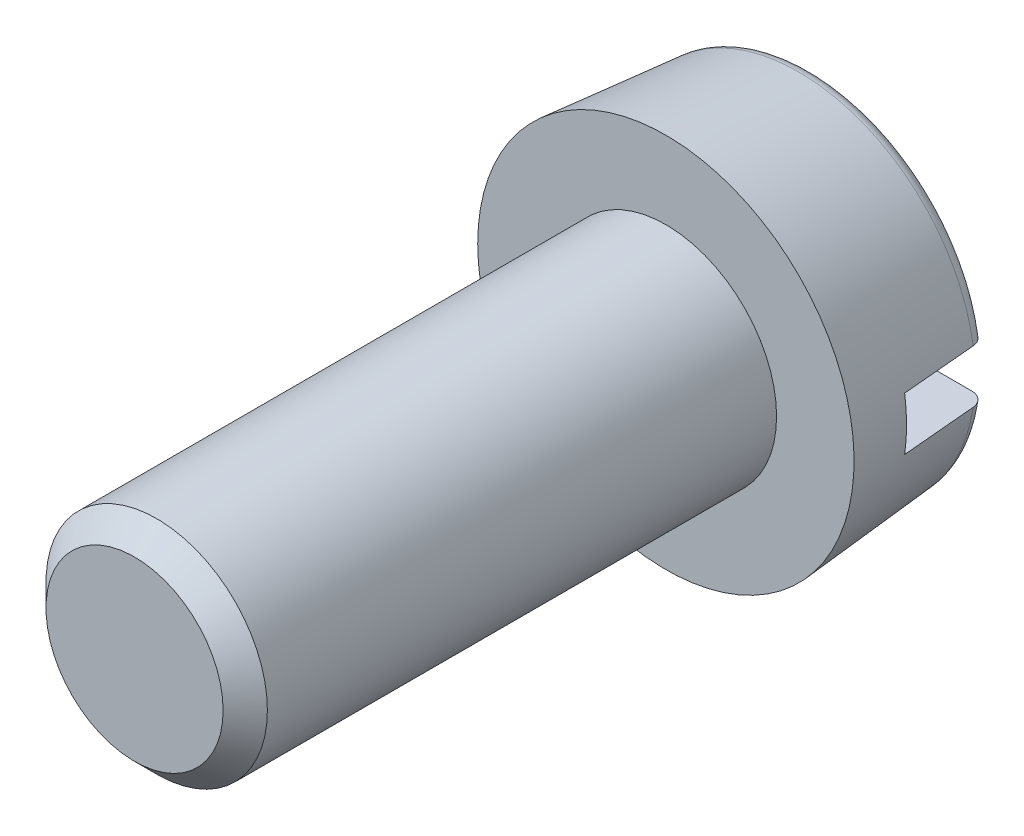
ISO-10303-21;
HEADER;
FILE_DESCRIPTION(('STEP AP214'),'2;1');
FILE_NAME('part.step','',(''),(''),'','','');
FILE_SCHEMA(('AUTOMOTIVE_DESIGN { 1 0 10303 214 1 1 1 1 }'));
ENDSEC;
DATA;
#1=APPLICATION_CONTEXT('core data for automotive mechanical design processes');
#2=APPLICATION_PROTOCOL_DEFINITION('international standard','automotive_design',2000,#1);
#3=PRODUCT_CONTEXT('',#1,'mechanical');
#4=PRODUCT('Part','Part','',(#3));
#5=PRODUCT_RELATED_PRODUCT_CATEGORY('part','',(#4));
#6=PRODUCT_DEFINITION_FORMATION('','',#4);
#7=PRODUCT_DEFINITION_CONTEXT('part definition',#1,'design');
#8=PRODUCT_DEFINITION('design','',#6,#7);
#9=PRODUCT_DEFINITION_SHAPE('','',#8);
#10=(LENGTH_UNIT() NAMED_UNIT(*) SI_UNIT(.MILLI.,.METRE.));
#11=(NAMED_UNIT(*) PLANE_ANGLE_UNIT() SI_UNIT($,.RADIAN.));
#12=(NAMED_UNIT(*) SI_UNIT($,.STERADIAN.) SOLID_ANGLE_UNIT());
#13=UNCERTAINTY_MEASURE_WITH_UNIT(LENGTH_MEASURE(1.E-05),#10,'distance_accuracy_value','');
#14=(GEOMETRIC_REPRESENTATION_CONTEXT(3) GLOBAL_UNCERTAINTY_ASSIGNED_CONTEXT((#13)) GLOBAL_UNIT_ASSIGNED_CONTEXT((#10,
#11,#12)) REPRESENTATION_CONTEXT('',''));
#15=CARTESIAN_POINT('',(0.,0.,0.));
#16=DIRECTION('',(0.,0.,1.));
#17=DIRECTION('',(1.,0.,0.));
#18=AXIS2_PLACEMENT_3D('',#15,#16,#17);
#19=CARTESIAN_POINT('',(0.,0.,-3.3));
#20=DIRECTION('',(0.,0.,1.));
#21=DIRECTION('',(1.,0.,0.));
#22=AXIS2_PLACEMENT_3D('',#19,#20,#21);
#23=PLANE('',#22);
#24=DIRECTION('',(1.,0.,0.));
#25=VECTOR('',#24,1.);
#26=CARTESIAN_POINT('',(-4.25,-0.6,-3.3));
#27=LINE('',#26,#25);
#28=CARTESIAN_POINT('',(-3.60936773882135,-0.6,-3.3));
#29=VERTEX_POINT('',#28);
#30=CARTESIAN_POINT('',(3.60936773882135,-0.6,-3.3));
#31=VERTEX_POINT('',#30);
#32=EDGE_CURVE('E184',#29,#31,#27,.T.);
#33=ORIENTED_EDGE('',*,*,#32,.T.);
#34=CARTESIAN_POINT('',(0.,0.,-3.3));
#35=DIRECTION('',(0.,0.,-1.));
#36=DIRECTION('',(-1.,0.,0.));
#37=AXIS2_PLACEMENT_3D('',#34,#35,#36);
#38=CIRCLE('',#37,3.6588981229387);
#39=EDGE_CURVE('E116',#31,#29,#38,.T.);
#40=ORIENTED_EDGE('',*,*,#39,.T.);
#41=EDGE_LOOP('',(#33,#40));
#42=FACE_BOUND('',#41,.T.);
#43=ADVANCED_FACE('F36',(#42),#23,.F.);
#44=DIRECTION('',(-1.,0.,0.));
#45=VECTOR('',#44,1.);
#46=CARTESIAN_POINT('',(-4.25,0.6,-3.3));
#47=LINE('',#46,#45);
#48=CARTESIAN_POINT('',(3.60936773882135,0.6,-3.3));
#49=VERTEX_POINT('',#48);
#50=CARTESIAN_POINT('',(-3.60936773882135,0.6,-3.3));
#51=VERTEX_POINT('',#50);
#52=EDGE_CURVE('E101',#49,#51,#47,.T.);
#53=ORIENTED_EDGE('',*,*,#52,.T.);
#54=EDGE_CURVE('E113',#51,#49,#38,.T.);
#55=ORIENTED_EDGE('',*,*,#54,.T.);
#56=EDGE_LOOP('',(#53,#55));
#57=FACE_BOUND('',#56,.T.);
#58=ADVANCED_FACE('F178',(#57),#23,.F.);
#59=CARTESIAN_POINT('',(0.,0.,-2.97));
#60=DIRECTION('',(0.,0.,-1.));
#61=DIRECTION('',(-1.,0.,0.));
#62=AXIS2_PLACEMENT_3D('',#59,#60,#61);
#63=TOROIDAL_SURFACE('',#62,3.6588981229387,0.330000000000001);
#64=CARTESIAN_POINT('',(-3.88093121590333,-0.6,-3.16235651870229));
#65=CARTESIAN_POINT('',(-3.89174650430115,-0.6,-3.14745596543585));
#66=CARTESIAN_POINT('',(-3.90131895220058,-0.6,-3.13163782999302));
#67=CARTESIAN_POINT('',(-3.91768386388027,-0.6,-3.09860811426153));
#68=CARTESIAN_POINT('',(-3.92447332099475,-0.6,-3.08139505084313));
#69=CARTESIAN_POINT('',(-3.93505791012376,-0.6,-3.04607287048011));
#70=CARTESIAN_POINT('',(-3.93885357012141,-0.6,-3.02796391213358));
#71=CARTESIAN_POINT('',(-3.94333535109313,-0.6,-2.99136961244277));
#72=CARTESIAN_POINT('',(-3.94402220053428,-0.6,-2.97288436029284));
#73=CARTESIAN_POINT('',(-3.94227140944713,-0.6,-2.9361368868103));
#74=CARTESIAN_POINT('',(-3.93984626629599,-0.6,-2.91787406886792));
#75=CARTESIAN_POINT('',(-3.93196602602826,-0.6,-2.88201412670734));
#76=CARTESIAN_POINT('',(-3.92651084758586,-0.6,-2.86441702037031));
#77=CARTESIAN_POINT('',(-3.91272898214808,-0.6,-2.83037210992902));
#78=CARTESIAN_POINT('',(-3.90440030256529,-0.6,-2.81392511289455));
#79=CARTESIAN_POINT('',(-3.88511861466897,-0.6,-2.78264968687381));
#80=CARTESIAN_POINT('',(-3.87416553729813,-0.6,-2.76782130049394));
#81=CARTESIAN_POINT('',(-3.84986660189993,-0.6,-2.74008712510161));
#82=CARTESIAN_POINT('',(-3.83650421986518,-0.6,-2.7271958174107));
#83=CARTESIAN_POINT('',(-3.80782590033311,-0.6,-2.70380952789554));
#84=CARTESIAN_POINT('',(-3.79250985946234,-0.6,-2.69331467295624));
#85=CARTESIAN_POINT('',(-3.76017561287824,-0.6,-2.67489241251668));
#86=CARTESIAN_POINT('',(-3.74314020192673,-0.6,-2.66699520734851));
#87=CARTESIAN_POINT('',(-3.70799548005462,-0.6,-2.65413616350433));
#88=CARTESIAN_POINT('',(-3.68988609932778,-0.6,-2.64917451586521));
#89=CARTESIAN_POINT('',(-3.65288598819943,-0.6,-2.64227180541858));
#90=CARTESIAN_POINT('',(-3.63398869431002,-0.6,-2.64036590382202));
#91=CARTESIAN_POINT('',(-3.59614043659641,-0.6,-2.63972980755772));
#92=CARTESIAN_POINT('',(-3.57718947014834,-0.6,-2.64099977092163));
#93=CARTESIAN_POINT('',(-3.53963364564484,-0.6,-2.64669886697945));
#94=CARTESIAN_POINT('',(-3.52103209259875,-0.6,-2.65114981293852));
#95=CARTESIAN_POINT('',(-3.48484117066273,-0.6,-2.66311534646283));
#96=CARTESIAN_POINT('',(-3.46725181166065,-0.6,-2.67062996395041));
#97=CARTESIAN_POINT('',(-3.43361753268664,-0.6,-2.68850884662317));
#98=CARTESIAN_POINT('',(-3.41757045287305,-0.6,-2.69886904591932));
#99=CARTESIAN_POINT('',(-3.38746679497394,-0.6,-2.72216302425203));
#100=CARTESIAN_POINT('',(-3.37341012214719,-0.6,-2.73509668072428));
#101=CARTESIAN_POINT('',(-3.34784979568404,-0.6,-2.76303096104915));
#102=CARTESIAN_POINT('',(-3.33632096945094,-0.6,-2.77800854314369));
#103=CARTESIAN_POINT('',(-3.31598781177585,-0.6,-2.80971149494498));
#104=CARTESIAN_POINT('',(-3.30718323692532,-0.6,-2.82643670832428));
#105=CARTESIAN_POINT('',(-3.29269082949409,-0.6,-2.86088519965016));
#106=CARTESIAN_POINT('',(-3.28695731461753,-0.6,-2.87858926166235));
#107=CARTESIAN_POINT('',(-3.27858571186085,-0.6,-2.91471449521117));
#108=CARTESIAN_POINT('',(-3.27594737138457,-0.6,-2.93313560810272));
#109=CARTESIAN_POINT('',(-3.27386359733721,-0.6,-2.96992922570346));
#110=CARTESIAN_POINT('',(-3.27437926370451,-0.6,-2.9882995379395));
#111=CARTESIAN_POINT('',(-3.27849603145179,-0.6,-3.02469054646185));
#112=CARTESIAN_POINT('',(-3.28209704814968,-0.6,-3.04271125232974));
#113=CARTESIAN_POINT('',(-3.29225896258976,-0.6,-3.0778495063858));
#114=CARTESIAN_POINT('',(-3.2988126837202,-0.6,-3.09496913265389));
#115=CARTESIAN_POINT('',(-3.31467711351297,-0.6,-3.12787861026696));
#116=CARTESIAN_POINT('',(-3.3239879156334,-0.6,-3.14366841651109));
#117=CARTESIAN_POINT('',(-3.34518159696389,-0.6,-3.17362232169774));
#118=CARTESIAN_POINT('',(-3.35708617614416,-0.6,-3.18777106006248));
#119=CARTESIAN_POINT('',(-3.38307011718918,-0.6,-3.21390575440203));
#120=CARTESIAN_POINT('',(-3.397149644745,-0.6,-3.22589154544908));
#121=CARTESIAN_POINT('',(-3.42730774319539,-0.6,-3.24754984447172));
#122=CARTESIAN_POINT('',(-3.44341295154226,-0.6,-3.25718526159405));
#123=CARTESIAN_POINT('',(-3.47699616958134,-0.6,-3.27365724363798));
#124=CARTESIAN_POINT('',(-3.49447428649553,-0.6,-3.28049358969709));
#125=CARTESIAN_POINT('',(-3.530559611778,-0.6,-3.29126249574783));
#126=CARTESIAN_POINT('',(-3.54917882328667,-0.6,-3.29515486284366));
#127=CARTESIAN_POINT('',(-3.58680532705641,-0.6,-3.29977905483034));
#128=CARTESIAN_POINT('',(-3.60581262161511,-0.6,-3.30051086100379));
#129=CARTESIAN_POINT('',(-3.64379387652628,-0.6,-3.29878612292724));
#130=CARTESIAN_POINT('',(-3.6627669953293,-0.6,-3.29631095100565));
#131=CARTESIAN_POINT('',(-3.70003092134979,-0.6,-3.2881993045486));
#132=CARTESIAN_POINT('',(-3.71832156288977,-0.6,-3.28256206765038));
#133=CARTESIAN_POINT('',(-3.75363601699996,-0.6,-3.26829463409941));
#134=CARTESIAN_POINT('',(-3.77066317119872,-0.6,-3.25967270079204));
#135=CARTESIAN_POINT('',(-3.80299261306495,-0.6,-3.23966998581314));
#136=CARTESIAN_POINT('',(-3.81829702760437,-0.6,-3.22829266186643));
#137=CARTESIAN_POINT('',(-3.84151948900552,-0.6,-3.20772421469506));
#138=CARTESIAN_POINT('',(-3.85009030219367,-0.6,-3.19925784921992));
#139=CARTESIAN_POINT('',(-3.86626148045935,-0.6,-3.18144383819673));
#140=CARTESIAN_POINT('',(-3.87386185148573,-0.6,-3.17209619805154));
#141=CARTESIAN_POINT('',(-3.88093121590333,-0.6,-3.16235651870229));
#142=B_SPLINE_CURVE_WITH_KNOTS('',3,(#64,#65,#66,#67,#68,#69,#70,#71,#72,#73,#74,#75,#76,#77,
#78,#79,#80,#81,#82,#83,#84,#85,#86,#87,#88,#89,#90,#91,#92,#93,#94,#95,#96,#97,#98,#99,#100,
#101,#102,#103,#104,#105,#106,#107,#108,#109,#110,#111,#112,#113,#114,#115,#116,#117,#118,#119,
#120,#121,#122,#123,#124,#125,#126,#127,#128,#129,#130,#131,#132,#133,#134,#135,#136,#137,#138,
#139,#140,#141),.UNSPECIFIED.,.T.,.F.,(4,2,2,2,2,2,2,2,2,2,2,2,2,2,2,2,2,2,2,2,2,2,2,2,2,2,2,2,
2,2,2,2,2,2,2,2,2,2,4),(0.,0.055192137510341,0.110443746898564,0.165685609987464,
0.220914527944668,0.275922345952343,0.330931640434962,0.38597915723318,0.441028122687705,
0.496470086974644,0.551914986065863,0.607983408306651,0.664055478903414,0.720768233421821,
0.777483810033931,0.834592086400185,0.891700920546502,0.948728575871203,1.00575351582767,
1.06218182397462,1.11860508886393,1.17416394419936,1.22971826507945,1.28458879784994,
1.3394578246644,1.39419420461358,1.44893244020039,1.50414752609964,1.55936682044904,
1.61540809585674,1.67145375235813,1.72825141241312,1.78504940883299,1.84217879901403,
1.89932196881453,1.95630818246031,2.0132232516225,2.04929956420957,2.08537565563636),.UNSPECIFIED.);
#143=CARTESIAN_POINT('',(-3.94224449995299,-0.6,-2.99876139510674));
#144=VERTEX_POINT('',#143);
#145=EDGE_CURVE('E58',#29,#144,#142,.T.);
#146=ORIENTED_EDGE('',*,*,#145,.F.);
#147=ORIENTED_EDGE('',*,*,#39,.F.);
#148=CARTESIAN_POINT('',(3.29440264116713,-0.6,-3.08230315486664));
#149=CARTESIAN_POINT('',(3.28809785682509,-0.6,-3.0651620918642));
#150=CARTESIAN_POINT('',(3.28322982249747,-0.6,-3.04747923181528));
#151=CARTESIAN_POINT('',(3.27652850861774,-0.6,-3.01153352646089));
#152=CARTESIAN_POINT('',(3.27469849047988,-0.6,-2.99327007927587));
#153=CARTESIAN_POINT('',(3.27413756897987,-0.6,-2.95670045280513));
#154=CARTESIAN_POINT('',(3.27540558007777,-0.6,-2.93839429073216));
#155=CARTESIAN_POINT('',(3.28099874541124,-0.6,-2.90226005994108));
#156=CARTESIAN_POINT('',(3.28532324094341,-0.6,-2.88443188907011));
#157=CARTESIAN_POINT('',(3.29689219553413,-0.6,-2.84975492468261));
#158=CARTESIAN_POINT('',(3.30413599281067,-0.6,-2.8329059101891));
#159=CARTESIAN_POINT('',(3.3213231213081,-0.6,-2.80064624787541));
#160=CARTESIAN_POINT('',(3.33126664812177,-0.6,-2.7852357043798));
#161=CARTESIAN_POINT('',(3.35366868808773,-0.6,-2.75612471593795));
#162=CARTESIAN_POINT('',(3.3661508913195,-0.6,-2.74244250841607));
#163=CARTESIAN_POINT('',(3.3932045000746,-0.6,-2.71732930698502));
#164=CARTESIAN_POINT('',(3.40777606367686,-0.6,-2.7058984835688));
#165=CARTESIAN_POINT('',(3.4388307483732,-0.6,-2.6854297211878));
#166=CARTESIAN_POINT('',(3.45533944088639,-0.6,-2.67643057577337));
#167=CARTESIAN_POINT('',(3.48961941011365,-0.6,-2.66129114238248));
#168=CARTESIAN_POINT('',(3.50739077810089,-0.6,-2.65515106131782));
#169=CARTESIAN_POINT('',(3.54393539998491,-0.6,-2.64582999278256));
#170=CARTESIAN_POINT('',(3.56271853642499,-0.6,-2.64268771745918));
#171=CARTESIAN_POINT('',(3.60054621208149,-0.6,-2.63958409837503));
#172=CARTESIAN_POINT('',(3.61959076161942,-0.6,-2.63962288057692));
#173=CARTESIAN_POINT('',(3.65749738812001,-0.6,-2.64289265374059));
#174=CARTESIAN_POINT('',(3.6763581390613,-0.6,-2.64613906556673));
#175=CARTESIAN_POINT('',(3.71326281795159,-0.6,-2.65576554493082));
#176=CARTESIAN_POINT('',(3.73130675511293,-0.6,-2.66214557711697));
#177=CARTESIAN_POINT('',(3.76597993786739,-0.6,-2.67783761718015));
#178=CARTESIAN_POINT('',(3.78261484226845,-0.6,-2.68713711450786));
#179=CARTESIAN_POINT('',(3.81406528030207,-0.6,-2.70842491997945));
#180=CARTESIAN_POINT('',(3.82888090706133,-0.6,-2.72041309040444));
#181=CARTESIAN_POINT('',(3.85610446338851,-0.6,-2.74660594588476));
#182=CARTESIAN_POINT('',(3.8685359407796,-0.6,-2.76078615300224));
#183=CARTESIAN_POINT('',(3.89080726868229,-0.6,-2.79105382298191));
#184=CARTESIAN_POINT('',(3.90064729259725,-0.6,-2.80714115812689));
#185=CARTESIAN_POINT('',(3.91733416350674,-0.6,-2.8405601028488));
#186=CARTESIAN_POINT('',(3.92421525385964,-0.6,-2.85787461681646));
#187=CARTESIAN_POINT('',(3.93494358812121,-0.6,-2.89341927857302));
#188=CARTESIAN_POINT('',(3.93879100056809,-0.6,-2.91164937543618));
#189=CARTESIAN_POINT('',(3.94331406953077,-0.6,-2.94833527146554));
#190=CARTESIAN_POINT('',(3.94401737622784,-0.6,-2.9667876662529));
#191=CARTESIAN_POINT('',(3.94230652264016,-0.6,-3.00354703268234));
#192=CARTESIAN_POINT('',(3.9398924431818,-0.6,-3.02185400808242));
#193=CARTESIAN_POINT('',(3.93203104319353,-0.6,-3.05775084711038));
#194=CARTESIAN_POINT('',(3.92659214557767,-0.6,-3.07534255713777));
#195=CARTESIAN_POINT('',(3.91284977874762,-0.6,-3.10936852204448));
#196=CARTESIAN_POINT('',(3.90454627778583,-0.6,-3.12580276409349));
#197=CARTESIAN_POINT('',(3.88528034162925,-0.6,-3.15712284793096));
#198=CARTESIAN_POINT('',(3.87430720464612,-0.6,-3.17200210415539));
#199=CARTESIAN_POINT('',(3.8500405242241,-0.6,-3.19972912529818));
#200=CARTESIAN_POINT('',(3.83674688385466,-0.6,-3.21257680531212));
#201=CARTESIAN_POINT('',(3.80808268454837,-0.6,-3.2360101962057));
#202=CARTESIAN_POINT('',(3.79269344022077,-0.6,-3.24657304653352));
#203=CARTESIAN_POINT('',(3.76037673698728,-0.6,-3.26500063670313));
#204=CARTESIAN_POINT('',(3.74344917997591,-0.6,-3.27286520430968));
#205=CARTESIAN_POINT('',(3.70832088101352,-0.6,-3.28577099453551));
#206=CARTESIAN_POINT('',(3.69010738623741,-0.6,-3.29077750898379));
#207=CARTESIAN_POINT('',(3.6531016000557,-0.6,-3.29769462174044));
#208=CARTESIAN_POINT('',(3.63430927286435,-0.6,-3.2996050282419));
#209=CARTESIAN_POINT('',(3.5964831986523,-0.6,-3.30028781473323));
#210=CARTESIAN_POINT('',(3.57744888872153,-0.6,-3.29902930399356));
#211=CARTESIAN_POINT('',(3.53985927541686,-0.6,-3.29334556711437));
#212=CARTESIAN_POINT('',(3.52130396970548,-0.6,-3.28892035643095));
#213=CARTESIAN_POINT('',(3.48514277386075,-0.6,-3.27700380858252));
#214=CARTESIAN_POINT('',(3.46753990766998,-0.6,-3.2695032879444));
#215=CARTESIAN_POINT('',(3.43384889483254,-0.6,-3.2516337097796));
#216=CARTESIAN_POINT('',(3.4177610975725,-0.6,-3.24126399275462));
#217=CARTESIAN_POINT('',(3.38766821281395,-0.6,-3.21800708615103));
#218=CARTESIAN_POINT('',(3.37365189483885,-0.6,-3.20513441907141));
#219=CARTESIAN_POINT('',(3.34803025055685,-0.6,-3.17719862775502));
#220=CARTESIAN_POINT('',(3.33642183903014,-0.6,-3.16213834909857));
#221=CARTESIAN_POINT('',(3.31975710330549,-0.6,-3.13617199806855));
#222=CARTESIAN_POINT('',(3.31386604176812,-0.6,-3.125791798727));
#223=CARTESIAN_POINT('',(3.30324676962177,-0.6,-3.10445241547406));
#224=CARTESIAN_POINT('',(3.29851854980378,-0.6,-3.09349323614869));
#225=CARTESIAN_POINT('',(3.29440264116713,-0.6,-3.08230315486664));
#226=B_SPLINE_CURVE_WITH_KNOTS('',3,(#148,#149,#150,#151,#152,#153,#154,#155,#156,#157,#158,
#159,#160,#161,#162,#163,#164,#165,#166,#167,#168,#169,#170,#171,#172,#173,#174,#175,#176,#177,
#178,#179,#180,#181,#182,#183,#184,#185,#186,#187,#188,#189,#190,#191,#192,#193,#194,#195,#196,
#197,#198,#199,#200,#201,#202,#203,#204,#205,#206,#207,#208,#209,#210,#211,#212,#213,#214,#215,
#216,#217,#218,#219,#220,#221,#222,#223,#224,#225),.UNSPECIFIED.,.T.,.F.,(4,2,2,2,2,2,2,2,2,2,2,
2,2,2,2,2,2,2,2,2,2,2,2,2,2,2,2,2,2,2,2,2,2,2,2,2,2,2,4),(0.,0.0547481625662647,
0.109555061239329,0.164342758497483,0.21911865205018,0.273882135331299,0.32864958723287,
0.383953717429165,0.439262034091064,0.495406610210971,0.551555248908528,0.608419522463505,
0.665286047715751,0.722427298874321,0.779567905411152,0.836466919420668,0.893363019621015,
0.949664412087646,1.00596203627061,1.06158935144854,1.11721357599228,1.17234765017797,
1.22748029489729,1.28246018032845,1.33744067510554,1.39264531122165,1.44785225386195,
1.50358833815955,1.55932797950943,1.61573086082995,1.67213723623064,1.72909558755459,
1.78605366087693,1.84318307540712,1.90032563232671,1.9571460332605,2.01389317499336,
2.04963432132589,2.08537518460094),.UNSPECIFIED.);
#227=CARTESIAN_POINT('',(3.94224449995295,-0.6,-2.99876139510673));
#228=VERTEX_POINT('',#227);
#229=EDGE_CURVE('E134',#228,#31,#226,.T.);
#230=ORIENTED_EDGE('',*,*,#229,.F.);
#231=CARTESIAN_POINT('',(0.,0.,-2.99876139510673));
#232=DIRECTION('',(0.,0.,-1.));
#233=DIRECTION('',(-1.,0.,0.));
#234=AXIS2_PLACEMENT_3D('',#231,#232,#233);
#235=CIRCLE('',#234,3.98764237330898);
#236=EDGE_CURVE('E125',#228,#144,#235,.T.);
#237=ORIENTED_EDGE('',*,*,#236,.T.);
#238=EDGE_LOOP('',(#146,#147,#230,#237));
#239=FACE_BOUND('',#238,.T.);
#240=ADVANCED_FACE('F138',(#239),#63,.T.);
#241=CARTESIAN_POINT('',(-3.88093121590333,0.6,-3.16235651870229));
#242=CARTESIAN_POINT('',(-3.86994562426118,0.6,-3.17748883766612));
#243=CARTESIAN_POINT('',(-3.8576617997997,0.6,-3.19169676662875));
#244=CARTESIAN_POINT('',(-3.83086570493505,0.6,-3.21785274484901));
#245=CARTESIAN_POINT('',(-3.81635047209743,0.6,-3.2297977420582));
#246=CARTESIAN_POINT('',(-3.78553913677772,0.6,-3.25107812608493));
#247=CARTESIAN_POINT('',(-3.76924481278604,0.6,-3.26041608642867));
#248=CARTESIAN_POINT('',(-3.73533536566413,0.6,-3.27624833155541));
#249=CARTESIAN_POINT('',(-3.71772056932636,0.6,-3.28274331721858));
#250=CARTESIAN_POINT('',(-3.68149968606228,0.6,-3.29277255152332));
#251=CARTESIAN_POINT('',(-3.66288621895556,0.6,-3.29628014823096));
#252=CARTESIAN_POINT('',(-3.62533412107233,0.6,-3.3001499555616));
#253=CARTESIAN_POINT('',(-3.60639545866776,0.6,-3.30051185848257));
#254=CARTESIAN_POINT('',(-3.56856016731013,0.6,-3.29807389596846));
#255=CARTESIAN_POINT('',(-3.54966526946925,0.6,-3.29524708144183));
#256=CARTESIAN_POINT('',(-3.51261639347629,0.6,-3.2864651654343));
#257=CARTESIAN_POINT('',(-3.49446243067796,0.6,-3.28050999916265));
#258=CARTESIAN_POINT('',(-3.45939741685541,0.6,-3.26562312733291));
#259=CARTESIAN_POINT('',(-3.44248757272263,0.6,-3.25668857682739));
#260=CARTESIAN_POINT('',(-3.41042432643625,0.6,-3.23608480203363));
#261=CARTESIAN_POINT('',(-3.39527086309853,0.6,-3.22441567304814));
#262=CARTESIAN_POINT('',(-3.36729252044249,0.6,-3.19877091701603));
#263=CARTESIAN_POINT('',(-3.35444928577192,0.6,-3.18481532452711));
#264=CARTESIAN_POINT('',(-3.33133020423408,0.6,-3.15491819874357));
#265=CARTESIAN_POINT('',(-3.32105414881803,0.6,-3.13897682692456));
#266=CARTESIAN_POINT('',(-3.30352389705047,0.6,-3.10581171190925));
#267=CARTESIAN_POINT('',(-3.29622739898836,0.6,-3.08861032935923));
#268=CARTESIAN_POINT('',(-3.28467217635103,0.6,-3.05321591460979));
#269=CARTESIAN_POINT('',(-3.28041318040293,0.6,-3.03502297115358));
#270=CARTESIAN_POINT('',(-3.27510706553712,0.6,-2.99843307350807));
#271=CARTESIAN_POINT('',(-3.2740161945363,0.6,-2.9800424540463));
#272=CARTESIAN_POINT('',(-3.27495596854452,0.6,-2.9433416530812));
#273=CARTESIAN_POINT('',(-3.27698647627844,0.6,-2.92503146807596));
#274=CARTESIAN_POINT('',(-3.28408517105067,0.6,-2.88911263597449));
#275=CARTESIAN_POINT('',(-3.28913704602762,0.6,-2.8715007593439));
#276=CARTESIAN_POINT('',(-3.30210833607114,0.6,-2.83736742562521));
#277=CARTESIAN_POINT('',(-3.31002780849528,0.6,-2.8208459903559));
#278=CARTESIAN_POINT('',(-3.32855183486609,0.6,-2.78924869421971));
#279=CARTESIAN_POINT('',(-3.33917251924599,0.6,-2.77418229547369));
#280=CARTESIAN_POINT('',(-3.36276008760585,0.6,-2.74601486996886));
#281=CARTESIAN_POINT('',(-3.37572713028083,0.6,-2.73291397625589));
#282=CARTESIAN_POINT('',(-3.40383191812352,0.6,-2.70885221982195));
#283=CARTESIAN_POINT('',(-3.41899752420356,0.6,-2.69792390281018));
#284=CARTESIAN_POINT('',(-3.45092687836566,0.6,-2.67872542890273));
#285=CARTESIAN_POINT('',(-3.46769075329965,0.6,-2.67045548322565));
#286=CARTESIAN_POINT('',(-3.50260223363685,0.6,-2.65668752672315));
#287=CARTESIAN_POINT('',(-3.52076636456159,0.6,-2.65123140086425));
#288=CARTESIAN_POINT('',(-3.55774960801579,0.6,-2.64341800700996));
#289=CARTESIAN_POINT('',(-3.57656875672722,0.6,-2.64106091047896));
#290=CARTESIAN_POINT('',(-3.61449273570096,0.6,-2.63950384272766));
#291=CARTESIAN_POINT('',(-3.63359864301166,0.6,-2.64032993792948));
#292=CARTESIAN_POINT('',(-3.67140054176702,0.6,-2.64518065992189));
#293=CARTESIAN_POINT('',(-3.69009653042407,0.6,-2.64920530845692));
#294=CARTESIAN_POINT('',(-3.72652506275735,0.6,-2.66034506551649));
#295=CARTESIAN_POINT('',(-3.74425851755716,0.6,-2.66745719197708));
#296=CARTESIAN_POINT('',(-3.77826491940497,0.6,-2.68458287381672));
#297=CARTESIAN_POINT('',(-3.7945379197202,0.6,-2.69459632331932));
#298=CARTESIAN_POINT('',(-3.82500810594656,0.6,-2.7171524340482));
#299=CARTESIAN_POINT('',(-3.83922196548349,0.6,-2.72967256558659));
#300=CARTESIAN_POINT('',(-3.86531446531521,0.6,-2.75694736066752));
#301=CARTESIAN_POINT('',(-3.87719325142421,0.6,-2.77170188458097));
#302=CARTESIAN_POINT('',(-3.89812780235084,0.6,-2.80283774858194));
#303=CARTESIAN_POINT('',(-3.90721554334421,0.6,-2.81919759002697));
#304=CARTESIAN_POINT('',(-3.922481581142,0.6,-2.85322194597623));
#305=CARTESIAN_POINT('',(-3.92866017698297,0.6,-2.87088632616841));
#306=CARTESIAN_POINT('',(-3.93786994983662,0.6,-2.9068184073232));
#307=CARTESIAN_POINT('',(-3.940933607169,0.6,-2.92507778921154));
#308=CARTESIAN_POINT('',(-3.9439344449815,0.6,-2.96185658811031));
#309=CARTESIAN_POINT('',(-3.94387094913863,0.6,-2.98037606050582));
#310=CARTESIAN_POINT('',(-3.94062675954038,0.6,-3.01704828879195));
#311=CARTESIAN_POINT('',(-3.93746096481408,0.6,-3.03520237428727));
#312=CARTESIAN_POINT('',(-3.92813087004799,0.6,-3.07070616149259));
#313=CARTESIAN_POINT('',(-3.92197027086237,0.6,-3.0880568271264));
#314=CARTESIAN_POINT('',(-3.90982474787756,0.6,-3.1148958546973));
#315=CARTESIAN_POINT('',(-3.90472284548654,0.6,-3.12479361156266));
#316=CARTESIAN_POINT('',(-3.89354422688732,0.6,-3.14402216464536));
#317=CARTESIAN_POINT('',(-3.88746751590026,0.6,-3.153352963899));
#318=CARTESIAN_POINT('',(-3.88093121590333,0.6,-3.16235651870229));
#319=B_SPLINE_CURVE_WITH_KNOTS('',3,(#241,#242,#243,#244,#245,#246,#247,#248,#249,#250,#251,
#252,#253,#254,#255,#256,#257,#258,#259,#260,#261,#262,#263,#264,#265,#266,#267,#268,#269,#270,
#271,#272,#273,#274,#275,#276,#277,#278,#279,#280,#281,#282,#283,#284,#285,#286,#287,#288,#289,
#290,#291,#292,#293,#294,#295,#296,#297,#298,#299,#300,#301,#302,#303,#304,#305,#306,#307,#308,
#309,#310,#311,#312,#313,#314,#315,#316,#317,#318),.UNSPECIFIED.,.T.,.F.,(4,2,2,2,2,2,2,2,2,2,2,
2,2,2,2,2,2,2,2,2,2,2,2,2,2,2,2,2,2,2,2,2,2,2,2,2,2,2,4),(0.,0.0560572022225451,
0.112189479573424,0.168266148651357,0.224328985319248,0.280886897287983,0.337450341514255,
0.394495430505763,0.451541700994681,0.508642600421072,0.565741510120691,0.622364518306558,
0.678982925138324,0.734766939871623,0.790545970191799,0.845550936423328,0.900553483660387,
0.955261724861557,1.00997106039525,1.06501509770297,1.12006285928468,1.17588167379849,
1.23170492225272,1.28833673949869,1.3449716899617,1.40207139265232,1.45917148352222,
1.51621654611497,1.57325952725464,1.6298111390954,1.68635921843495,1.74223294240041,
1.79810092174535,1.85338018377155,1.9086714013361,1.96369837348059,2.01865751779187,
2.05201108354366,2.08536447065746),.UNSPECIFIED.);
#320=CARTESIAN_POINT('',(-3.94224449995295,0.6,-2.99876139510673));
#321=VERTEX_POINT('',#320);
#322=EDGE_CURVE('E190',#321,#51,#319,.T.);
#323=ORIENTED_EDGE('',*,*,#322,.F.);
#324=CARTESIAN_POINT('',(3.94224449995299,0.6,-2.99876139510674));
#325=VERTEX_POINT('',#324);
#326=EDGE_CURVE('E121',#321,#325,#235,.T.);
#327=ORIENTED_EDGE('',*,*,#326,.T.);
#328=CARTESIAN_POINT('',(3.29440264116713,0.6,-3.08230315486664));
#329=CARTESIAN_POINT('',(3.30080765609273,0.6,-3.09971174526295));
#330=CARTESIAN_POINT('',(3.30870432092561,0.6,-3.11658702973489));
#331=CARTESIAN_POINT('',(3.32723725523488,0.6,-3.14877873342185));
#332=CARTESIAN_POINT('',(3.33787720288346,0.6,-3.16409302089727));
#333=CARTESIAN_POINT('',(3.36155741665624,0.6,-3.19270893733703));
#334=CARTESIAN_POINT('',(3.37459497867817,0.6,-3.20601280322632));
#335=CARTESIAN_POINT('',(3.40269212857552,0.6,-3.23026849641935));
#336=CARTESIAN_POINT('',(3.4177512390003,0.6,-3.24122087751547));
#337=CARTESIAN_POINT('',(3.44964717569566,0.6,-3.26060347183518));
#338=CARTESIAN_POINT('',(3.46650214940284,0.6,-3.26900382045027));
#339=CARTESIAN_POINT('',(3.50137211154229,0.6,-3.28289497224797));
#340=CARTESIAN_POINT('',(3.5193872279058,0.6,-3.28838545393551));
#341=CARTESIAN_POINT('',(3.55629957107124,0.6,-3.29636116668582));
#342=CARTESIAN_POINT('',(3.57520482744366,0.6,-3.29880927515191));
#343=CARTESIAN_POINT('',(3.6131589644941,0.6,-3.30051042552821));
#344=CARTESIAN_POINT('',(3.63220784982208,0.6,-3.29976336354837));
#345=CARTESIAN_POINT('',(3.66998396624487,0.6,-3.29508032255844));
#346=CARTESIAN_POINT('',(3.68870969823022,0.6,-3.29113222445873));
#347=CARTESIAN_POINT('',(3.72522679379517,0.6,-3.28013231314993));
#348=CARTESIAN_POINT('',(3.74301817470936,0.6,-3.27308055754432));
#349=CARTESIAN_POINT('',(3.77706024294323,0.6,-3.25610444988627));
#350=CARTESIAN_POINT('',(3.79331833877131,0.6,-3.24619496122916));
#351=CARTESIAN_POINT('',(3.82391612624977,0.6,-3.22375887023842));
#352=CARTESIAN_POINT('',(3.83825591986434,0.6,-3.21123240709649));
#353=CARTESIAN_POINT('',(3.86444180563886,0.6,-3.18406202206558));
#354=CARTESIAN_POINT('',(3.87631328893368,0.6,-3.16944257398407));
#355=CARTESIAN_POINT('',(3.89739845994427,0.6,-3.13839826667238));
#356=CARTESIAN_POINT('',(3.90661232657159,0.6,-3.12197352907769));
#357=CARTESIAN_POINT('',(3.92200844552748,0.6,-3.08799315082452));
#358=CARTESIAN_POINT('',(3.92822509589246,0.6,-3.07045309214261));
#359=CARTESIAN_POINT('',(3.93759777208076,0.6,-3.03457355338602));
#360=CARTESIAN_POINT('',(3.94075395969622,0.6,-3.01623411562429));
#361=CARTESIAN_POINT('',(3.94389612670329,0.6,-2.97943863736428));
#362=CARTESIAN_POINT('',(3.94390805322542,0.6,-2.96098480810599));
#363=CARTESIAN_POINT('',(3.94082654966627,0.6,-2.92433862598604));
#364=CARTESIAN_POINT('',(3.93773318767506,0.6,-2.90614626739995));
#365=CARTESIAN_POINT('',(3.92854399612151,0.6,-2.87057609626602));
#366=CARTESIAN_POINT('',(3.92245422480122,0.6,-2.85319671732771));
#367=CARTESIAN_POINT('',(3.90745683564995,0.6,-2.81970013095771));
#368=CARTESIAN_POINT('',(3.89854917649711,0.6,-2.80358294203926));
#369=CARTESIAN_POINT('',(3.87812899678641,0.6,-2.77298178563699));
#370=CARTESIAN_POINT('',(3.86660420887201,0.6,-2.75850600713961));
#371=CARTESIAN_POINT('',(3.84130994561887,0.6,-2.73167090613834));
#372=CARTESIAN_POINT('',(3.82754036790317,0.6,-2.7193116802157));
#373=CARTESIAN_POINT('',(3.79800175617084,0.6,-2.69692584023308));
#374=CARTESIAN_POINT('',(3.78221405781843,0.6,-2.68692385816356));
#375=CARTESIAN_POINT('',(3.74919897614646,0.6,-2.66967626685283));
#376=CARTESIAN_POINT('',(3.73197150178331,0.6,-2.66243083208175));
#377=CARTESIAN_POINT('',(3.69634648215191,0.6,-2.65081249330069));
#378=CARTESIAN_POINT('',(3.67793745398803,0.6,-2.64647479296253));
#379=CARTESIAN_POINT('',(3.64065434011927,0.6,-2.64092020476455));
#380=CARTESIAN_POINT('',(3.62178022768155,0.6,-2.63970349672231));
#381=CARTESIAN_POINT('',(3.58391704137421,0.6,-2.64042180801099));
#382=CARTESIAN_POINT('',(3.56492851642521,0.6,-2.64238604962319));
#383=CARTESIAN_POINT('',(3.5275479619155,0.6,-2.64946677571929));
#384=CARTESIAN_POINT('',(3.50915595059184,0.6,-2.65458335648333));
#385=CARTESIAN_POINT('',(3.47345279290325,0.6,-2.66784659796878));
#386=CARTESIAN_POINT('',(3.45614406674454,0.6,-2.67599977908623));
#387=CARTESIAN_POINT('',(3.42315400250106,0.6,-2.6951161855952));
#388=CARTESIAN_POINT('',(3.40747262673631,0.6,-2.70607934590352));
#389=CARTESIAN_POINT('',(3.3783088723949,0.6,-2.73042905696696));
#390=CARTESIAN_POINT('',(3.36481164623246,0.6,-2.74379781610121));
#391=CARTESIAN_POINT('',(3.34029306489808,0.6,-2.77263980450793));
#392=CARTESIAN_POINT('',(3.32927141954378,0.6,-2.78811278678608));
#393=CARTESIAN_POINT('',(3.31018691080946,0.6,-2.82048808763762));
#394=CARTESIAN_POINT('',(3.30208390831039,0.6,-2.83736674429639));
#395=CARTESIAN_POINT('',(3.28887246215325,0.6,-2.87226338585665));
#396=CARTESIAN_POINT('',(3.28376451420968,0.6,-2.89028155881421));
#397=CARTESIAN_POINT('',(3.27675958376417,0.6,-2.92666745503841));
#398=CARTESIAN_POINT('',(3.27481863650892,0.6,-2.945026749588));
#399=CARTESIAN_POINT('',(3.27407466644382,0.6,-2.98179276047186));
#400=CARTESIAN_POINT('',(3.27526757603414,0.6,-3.00019938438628));
#401=CARTESIAN_POINT('',(3.27964288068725,0.6,-3.02926106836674));
#402=CARTESIAN_POINT('',(3.28183959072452,0.6,-3.04007400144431));
#403=CARTESIAN_POINT('',(3.2873161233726,0.6,-3.06142179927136));
#404=CARTESIAN_POINT('',(3.29059593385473,0.6,-3.07195666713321));
#405=CARTESIAN_POINT('',(3.29440264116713,0.6,-3.08230315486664));
#406=B_SPLINE_CURVE_WITH_KNOTS('',3,(#328,#329,#330,#331,#332,#333,#334,#335,#336,#337,#338,
#339,#340,#341,#342,#343,#344,#345,#346,#347,#348,#349,#350,#351,#352,#353,#354,#355,#356,#357,
#358,#359,#360,#361,#362,#363,#364,#365,#366,#367,#368,#369,#370,#371,#372,#373,#374,#375,#376,
#377,#378,#379,#380,#381,#382,#383,#384,#385,#386,#387,#388,#389,#390,#391,#392,#393,#394,#395,
#396,#397,#398,#399,#400,#401,#402,#403,#404,#405),.UNSPECIFIED.,.T.,.F.,(4,2,2,2,2,2,2,2,2,2,2,
2,2,2,2,2,2,2,2,2,2,2,2,2,2,2,2,2,2,2,2,2,2,2,2,2,2,2,4),(0.,0.0556074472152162,
0.111289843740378,0.16690982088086,0.222516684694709,0.278751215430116,0.334991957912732,
0.391912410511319,0.448834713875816,0.505973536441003,0.563111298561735,0.619957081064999,
0.676799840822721,0.733025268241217,0.789246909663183,0.844806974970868,0.90036410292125,
0.955462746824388,1.0105601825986,1.06554667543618,1.12053397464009,1.1757845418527,
1.23103762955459,1.28684474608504,1.3426553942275,1.3991300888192,1.45560803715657,
1.51260777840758,1.56960926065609,1.62673385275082,1.6838571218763,1.74057408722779,
1.79728440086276,1.85318199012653,1.909088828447,1.96421274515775,2.01926514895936,
2.05231482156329,2.08536412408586),.UNSPECIFIED.);
#407=EDGE_CURVE('E191',#49,#325,#406,.T.);
#408=ORIENTED_EDGE('',*,*,#407,.F.);
#409=ORIENTED_EDGE('',*,*,#54,.F.);
#410=EDGE_LOOP('',(#323,#327,#408,#409));
#411=FACE_BOUND('',#410,.T.);
#412=ADVANCED_FACE('F163',(#411),#63,.T.);
#413=CARTESIAN_POINT('',(0.,0.,0.));
#414=DIRECTION('',(0.,0.,1.));
#415=DIRECTION('',(1.,0.,0.));
#416=AXIS2_PLACEMENT_3D('',#413,#414,#415);
#417=CONICAL_SURFACE('',#416,4.25,0.0872664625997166);
#418=CARTESIAN_POINT('',(0.,0.,0.));
#419=DIRECTION('',(0.,0.,-1.));
#420=DIRECTION('',(-1.,0.,0.));
#421=AXIS2_PLACEMENT_3D('',#418,#419,#420);
#422=CIRCLE('',#421,4.25);
#423=CARTESIAN_POINT('',(-4.25,0.,0.));
#424=VERTEX_POINT('',#423);
#425=EDGE_CURVE('E126',#424,#424,#422,.T.);
#426=ORIENTED_EDGE('',*,*,#425,.T.);
#427=EDGE_LOOP('',(#426));
#428=FACE_BOUND('',#427,.T.);
#429=CARTESIAN_POINT('',(-3.35207905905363,-0.6,-9.65435105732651));
#430=CARTESIAN_POINT('',(-3.53693192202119,-0.6,-7.57431453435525));
#431=CARTESIAN_POINT('',(-3.7213593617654,-0.6,-5.4942402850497));
#432=CARTESIAN_POINT('',(-3.94063586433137,-0.6,-3.01698288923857));
#433=CARTESIAN_POINT('',(-3.97577932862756,-0.6,-2.61982580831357));
#434=CARTESIAN_POINT('',(-4.23005524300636,-0.6,0.2546013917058));
#435=CARTESIAN_POINT('',(-4.44879710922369,-0.6,2.73190607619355));
#436=CARTESIAN_POINT('',(-4.66734058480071,-0.6,5.20922820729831));
#437=B_SPLINE_CURVE_WITH_KNOTS('',3,(#429,#430,#431,#432,#433,#434,#435,#436),.UNSPECIFIED.,.F.,
.F.,(4,2,2,4),(0.,6.26470276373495,7.46082955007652,14.9216590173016),.UNSPECIFIED.);
#438=CARTESIAN_POINT('',(-4.09251584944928,-0.6,-1.3));
#439=VERTEX_POINT('',#438);
#440=EDGE_CURVE('E86',#144,#439,#437,.T.);
#441=ORIENTED_EDGE('',*,*,#440,.F.);
#442=ORIENTED_EDGE('',*,*,#236,.F.);
#443=CARTESIAN_POINT('',(4.66734058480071,-0.6,5.20922820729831));
#444=CARTESIAN_POINT('',(4.55807835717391,-0.6,3.9705662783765));
#445=CARTESIAN_POINT('',(4.44875735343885,-0.6,2.73190953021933));
#446=CARTESIAN_POINT('',(4.22996044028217,-0.6,0.254609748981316));
#447=CARTESIAN_POINT('',(4.12048453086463,-0.6,-0.984033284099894));
#448=CARTESIAN_POINT('',(3.90134044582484,-0.6,-3.46130236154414));
#449=CARTESIAN_POINT('',(3.79167227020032,-0.6,-4.69992840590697));
#450=CARTESIAN_POINT('',(3.57208175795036,-0.6,-7.1771579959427));
#451=CARTESIAN_POINT('',(3.46215942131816,-0.6,-8.415761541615));
#452=CARTESIAN_POINT('',(3.35207905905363,-0.6,-9.65435105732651));
#453=B_SPLINE_CURVE_WITH_KNOTS('',3,(#443,#444,#445,#446,#447,#448,#449,#450,#451,#452),
.UNSPECIFIED.,.F.,.F.,(4,2,2,2,4),(0.,3.73041479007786,7.4608294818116,11.1912442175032,
14.9216590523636),.UNSPECIFIED.);
#454=CARTESIAN_POINT('',(4.09251584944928,-0.6,-1.3));
#455=VERTEX_POINT('',#454);
#456=EDGE_CURVE('E106',#455,#228,#453,.T.);
#457=ORIENTED_EDGE('',*,*,#456,.F.);
#458=CARTESIAN_POINT('',(0.,0.,-1.3));
#459=DIRECTION('',(0.,0.,1.));
#460=DIRECTION('',(1.,0.,0.));
#461=AXIS2_PLACEMENT_3D('',#458,#459,#460);
#462=CIRCLE('',#461,4.1362647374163);
#463=CARTESIAN_POINT('',(4.09251584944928,0.6,-1.3));
#464=VERTEX_POINT('',#463);
#465=EDGE_CURVE('E100',#455,#464,#462,.T.);
#466=ORIENTED_EDGE('',*,*,#465,.T.);
#467=CARTESIAN_POINT('',(3.35207905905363,0.6,-9.65435105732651));
#468=CARTESIAN_POINT('',(3.53693192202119,0.6,-7.57431453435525));
#469=CARTESIAN_POINT('',(3.7213593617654,0.6,-5.4942402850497));
#470=CARTESIAN_POINT('',(3.94063586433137,0.6,-3.01698288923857));
#471=CARTESIAN_POINT('',(3.97577932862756,0.6,-2.61982580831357));
#472=CARTESIAN_POINT('',(4.23005524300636,0.6,0.2546013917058));
#473=CARTESIAN_POINT('',(4.44879710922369,0.6,2.73190607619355));
#474=CARTESIAN_POINT('',(4.66734058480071,0.6,5.20922820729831));
#475=B_SPLINE_CURVE_WITH_KNOTS('',3,(#467,#468,#469,#470,#471,#472,#473,#474),.UNSPECIFIED.,.F.,
.F.,(4,2,2,4),(0.,6.26470276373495,7.46082955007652,14.9216590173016),.UNSPECIFIED.);
#476=EDGE_CURVE('E109',#325,#464,#475,.T.);
#477=ORIENTED_EDGE('',*,*,#476,.F.);
#478=ORIENTED_EDGE('',*,*,#326,.F.);
#479=CARTESIAN_POINT('',(-4.66734058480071,0.6,5.20922820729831));
#480=CARTESIAN_POINT('',(-4.55807835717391,0.6,3.9705662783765));
#481=CARTESIAN_POINT('',(-4.44875735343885,0.6,2.73190953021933));
#482=CARTESIAN_POINT('',(-4.22996044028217,0.6,0.254609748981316));
#483=CARTESIAN_POINT('',(-4.12048453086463,0.6,-0.984033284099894));
#484=CARTESIAN_POINT('',(-3.90134044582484,0.6,-3.46130236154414));
#485=CARTESIAN_POINT('',(-3.79167227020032,0.6,-4.69992840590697));
#486=CARTESIAN_POINT('',(-3.57208175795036,0.6,-7.1771579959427));
#487=CARTESIAN_POINT('',(-3.46215942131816,0.6,-8.415761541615));
#488=CARTESIAN_POINT('',(-3.35207905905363,0.6,-9.65435105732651));
#489=B_SPLINE_CURVE_WITH_KNOTS('',3,(#479,#480,#481,#482,#483,#484,#485,#486,#487,#488),
.UNSPECIFIED.,.F.,.F.,(4,2,2,2,4),(0.,3.73041479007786,7.4608294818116,11.1912442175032,
14.9216590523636),.UNSPECIFIED.);
#490=CARTESIAN_POINT('',(-4.09251584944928,0.6,-1.3));
#491=VERTEX_POINT('',#490);
#492=EDGE_CURVE('E95',#491,#321,#489,.T.);
#493=ORIENTED_EDGE('',*,*,#492,.F.);
#494=EDGE_CURVE('E98',#491,#439,#462,.T.);
#495=ORIENTED_EDGE('',*,*,#494,.T.);
#496=EDGE_LOOP('',(#441,#442,#457,#466,#477,#478,#493,#495));
#497=FACE_BOUND('',#496,.T.);
#498=ADVANCED_FACE('F104',(#428,#497),#417,.T.);
#499=CARTESIAN_POINT('',(0.,0.,0.));
#500=DIRECTION('',(0.,0.,-1.));
#501=DIRECTION('',(-1.,0.,0.));
#502=AXIS2_PLACEMENT_3D('',#499,#500,#501);
#503=PLANE('',#502);
#504=CARTESIAN_POINT('',(0.,0.,0.));
#505=DIRECTION('',(0.,0.,1.));
#506=DIRECTION('',(1.,0.,0.));
#507=AXIS2_PLACEMENT_3D('',#504,#505,#506);
#508=CIRCLE('',#507,2.5);
#509=CARTESIAN_POINT('',(2.5,0.,0.));
#510=VERTEX_POINT('',#509);
#511=EDGE_CURVE('E186',#510,#510,#508,.T.);
#512=ORIENTED_EDGE('',*,*,#511,.F.);
#513=EDGE_LOOP('',(#512));
#514=FACE_BOUND('',#513,.T.);
#515=ORIENTED_EDGE('',*,*,#425,.F.);
#516=EDGE_LOOP('',(#515));
#517=FACE_BOUND('',#516,.T.);
#518=ADVANCED_FACE('F146',(#514,#517),#503,.F.);
#519=CARTESIAN_POINT('',(-4.25,-0.6,-1.3));
#520=DIRECTION('',(0.,1.,0.));
#521=DIRECTION('',(-1.,0.,0.));
#522=AXIS2_PLACEMENT_3D('',#519,#520,#521);
#523=PLANE('',#522);
#524=ORIENTED_EDGE('',*,*,#145,.T.);
#525=ORIENTED_EDGE('',*,*,#440,.T.);
#526=DIRECTION('',(1.,0.,0.));
#527=VECTOR('',#526,1.);
#528=CARTESIAN_POINT('',(-4.25,-0.6,-1.3));
#529=LINE('',#528,#527);
#530=EDGE_CURVE('E89',#439,#455,#529,.T.);
#531=ORIENTED_EDGE('',*,*,#530,.T.);
#532=ORIENTED_EDGE('',*,*,#456,.T.);
#533=ORIENTED_EDGE('',*,*,#229,.T.);
#534=ORIENTED_EDGE('',*,*,#32,.F.);
#535=EDGE_LOOP('',(#524,#525,#531,#532,#533,#534));
#536=FACE_BOUND('',#535,.T.);
#537=ADVANCED_FACE('F88',(#536),#523,.T.);
#538=CARTESIAN_POINT('',(-4.25,0.6,-1.3));
#539=DIRECTION('',(0.,-1.,0.));
#540=DIRECTION('',(0.,0.,-1.));
#541=AXIS2_PLACEMENT_3D('',#538,#539,#540);
#542=PLANE('',#541);
#543=ORIENTED_EDGE('',*,*,#322,.T.);
#544=ORIENTED_EDGE('',*,*,#52,.F.);
#545=ORIENTED_EDGE('',*,*,#407,.T.);
#546=ORIENTED_EDGE('',*,*,#476,.T.);
#547=DIRECTION('',(-1.,0.,0.));
#548=VECTOR('',#547,1.);
#549=CARTESIAN_POINT('',(-4.25,0.6,-1.3));
#550=LINE('',#549,#548);
#551=EDGE_CURVE('E50',#464,#491,#550,.T.);
#552=ORIENTED_EDGE('',*,*,#551,.T.);
#553=ORIENTED_EDGE('',*,*,#492,.T.);
#554=EDGE_LOOP('',(#543,#544,#545,#546,#552,#553));
#555=FACE_BOUND('',#554,.T.);
#556=ADVANCED_FACE('F145',(#555),#542,.T.);
#557=CARTESIAN_POINT('',(-4.25,0.6,-1.3));
#558=DIRECTION('',(0.,0.,1.));
#559=DIRECTION('',(1.,0.,0.));
#560=AXIS2_PLACEMENT_3D('',#557,#558,#559);
#561=PLANE('',#560);
#562=ORIENTED_EDGE('',*,*,#551,.F.);
#563=ORIENTED_EDGE('',*,*,#465,.F.);
#564=ORIENTED_EDGE('',*,*,#530,.F.);
#565=ORIENTED_EDGE('',*,*,#494,.F.);
#566=EDGE_LOOP('',(#562,#563,#564,#565));
#567=FACE_BOUND('',#566,.T.);
#568=ADVANCED_FACE('F97',(#567),#561,.F.);
#569=CARTESIAN_POINT('',(0.,0.,12.));
#570=DIRECTION('',(0.,0.,1.));
#571=DIRECTION('',(1.,0.,0.));
#572=AXIS2_PLACEMENT_3D('',#569,#570,#571);
#573=PLANE('',#572);
#574=CARTESIAN_POINT('',(0.,0.,12.));
#575=DIRECTION('',(0.,0.,1.));
#576=DIRECTION('',(1.,0.,0.));
#577=AXIS2_PLACEMENT_3D('',#574,#575,#576);
#578=CIRCLE('',#577,2.);
#579=CARTESIAN_POINT('',(2.,0.,12.));
#580=VERTEX_POINT('',#579);
#581=EDGE_CURVE('E43',#580,#580,#578,.T.);
#582=ORIENTED_EDGE('',*,*,#581,.T.);
#583=EDGE_LOOP('',(#582));
#584=FACE_BOUND('',#583,.T.);
#585=ADVANCED_FACE('F213',(#584),#573,.T.);
#586=CARTESIAN_POINT('',(0.,0.,0.));
#587=DIRECTION('',(0.,0.,1.));
#588=DIRECTION('',(1.,0.,0.));
#589=AXIS2_PLACEMENT_3D('',#586,#587,#588);
#590=CYLINDRICAL_SURFACE('',#589,2.5);
#591=CARTESIAN_POINT('',(0.,0.,11.5));
#592=DIRECTION('',(0.,0.,1.));
#593=DIRECTION('',(1.,0.,0.));
#594=AXIS2_PLACEMENT_3D('',#591,#592,#593);
#595=CIRCLE('',#594,2.5);
#596=CARTESIAN_POINT('',(2.5,0.,11.5));
#597=VERTEX_POINT('',#596);
#598=EDGE_CURVE('E11',#597,#597,#595,.F.);
#599=ORIENTED_EDGE('',*,*,#598,.T.);
#600=EDGE_LOOP('',(#599));
#601=FACE_BOUND('',#600,.T.);
#602=ORIENTED_EDGE('',*,*,#511,.T.);
#603=EDGE_LOOP('',(#602));
#604=FACE_BOUND('',#603,.T.);
#605=ADVANCED_FACE('F208',(#601,#604),#590,.T.);
#606=CARTESIAN_POINT('',(0.,0.,12.));
#607=DIRECTION('',(0.,0.,-1.));
#608=DIRECTION('',(-1.,0.,0.));
#609=AXIS2_PLACEMENT_3D('',#606,#607,#608);
#610=CONICAL_SURFACE('',#609,2.,0.785398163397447);
#611=ORIENTED_EDGE('',*,*,#598,.F.);
#612=EDGE_LOOP('',(#611));
#613=FACE_BOUND('',#612,.T.);
#614=ORIENTED_EDGE('',*,*,#581,.F.);
#615=EDGE_LOOP('',(#614));
#616=FACE_BOUND('',#615,.T.);
#617=ADVANCED_FACE('F212',(#613,#616),#610,.T.);
#618=CLOSED_SHELL('',(#43,#58,#240,#412,#498,#518,#537,#556,#568,#585,#605,#617));
#619=MANIFOLD_SOLID_BREP('B2',#618);
#620=ADVANCED_BREP_SHAPE_REPRESENTATION('',(#18,#619),#14);
#621=SHAPE_DEFINITION_REPRESENTATION(#9,#620);
ENDSEC;
END-ISO-10303-21;
